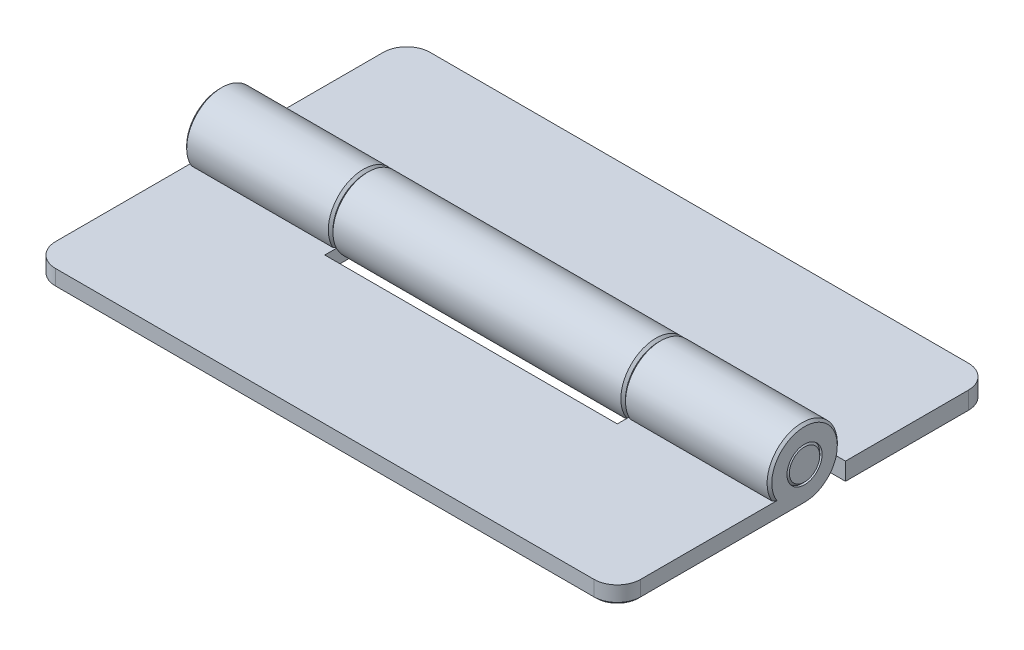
ISO-10303-21;
HEADER;
FILE_DESCRIPTION(('STEP AP214'),'2;1');
FILE_NAME('part.step','',(''),(''),'','','');
FILE_SCHEMA(('AUTOMOTIVE_DESIGN { 1 0 10303 214 1 1 1 1 }'));
ENDSEC;
DATA;
#1=APPLICATION_CONTEXT('core data for automotive mechanical design processes');
#2=APPLICATION_PROTOCOL_DEFINITION('international standard','automotive_design',2000,#1);
#3=PRODUCT_CONTEXT('',#1,'mechanical');
#4=PRODUCT('Part','Part','',(#3));
#5=PRODUCT_RELATED_PRODUCT_CATEGORY('part','',(#4));
#6=PRODUCT_DEFINITION_FORMATION('','',#4);
#7=PRODUCT_DEFINITION_CONTEXT('part definition',#1,'design');
#8=PRODUCT_DEFINITION('design','',#6,#7);
#9=PRODUCT_DEFINITION_SHAPE('','',#8);
#10=(LENGTH_UNIT() NAMED_UNIT(*) SI_UNIT(.MILLI.,.METRE.));
#11=(NAMED_UNIT(*) PLANE_ANGLE_UNIT() SI_UNIT($,.RADIAN.));
#12=(NAMED_UNIT(*) SI_UNIT($,.STERADIAN.) SOLID_ANGLE_UNIT());
#13=UNCERTAINTY_MEASURE_WITH_UNIT(LENGTH_MEASURE(1.E-05),#10,'distance_accuracy_value','');
#14=(GEOMETRIC_REPRESENTATION_CONTEXT(3) GLOBAL_UNCERTAINTY_ASSIGNED_CONTEXT((#13)) GLOBAL_UNIT_ASSIGNED_CONTEXT((#10,
#11,#12)) REPRESENTATION_CONTEXT('',''));
#15=CARTESIAN_POINT('',(0.,0.,0.));
#16=DIRECTION('',(0.,0.,1.));
#17=DIRECTION('',(1.,0.,0.));
#18=AXIS2_PLACEMENT_3D('',#15,#16,#17);
#19=CARTESIAN_POINT('',(25.,0.,0.));
#20=DIRECTION('',(-1.,0.,0.));
#21=DIRECTION('',(0.,0.,1.));
#22=AXIS2_PLACEMENT_3D('',#19,#20,#21);
#23=CYLINDRICAL_SURFACE('',#22,3.);
#24=DIRECTION('',(-1.,0.,0.));
#25=VECTOR('',#24,1.);
#26=CARTESIAN_POINT('',(25.,-1.5,2.59807621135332));
#27=LINE('',#26,#25);
#28=CARTESIAN_POINT('',(24.8,-1.5,2.59807621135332));
#29=VERTEX_POINT('',#28);
#30=CARTESIAN_POINT('',(12.7,-1.5,2.59807621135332));
#31=VERTEX_POINT('',#30);
#32=EDGE_CURVE('P0_E190',#29,#31,#27,.T.);
#33=ORIENTED_EDGE('',*,*,#32,.F.);
#34=CARTESIAN_POINT('',(24.8,0.,0.));
#35=DIRECTION('',(1.,0.,0.));
#36=DIRECTION('',(0.,0.,-1.));
#37=AXIS2_PLACEMENT_3D('',#34,#35,#36);
#38=CIRCLE('',#37,3.);
#39=CARTESIAN_POINT('',(24.8,-3.,0.));
#40=VERTEX_POINT('',#39);
#41=EDGE_CURVE('P0_E206',#29,#40,#38,.F.);
#42=ORIENTED_EDGE('',*,*,#41,.T.);
#43=DIRECTION('',(-1.,0.,0.));
#44=VECTOR('',#43,1.);
#45=CARTESIAN_POINT('',(25.,-3.,0.));
#46=LINE('',#45,#44);
#47=CARTESIAN_POINT('',(12.7,-3.,0.));
#48=VERTEX_POINT('',#47);
#49=EDGE_CURVE('P0_E140',#40,#48,#46,.T.);
#50=ORIENTED_EDGE('',*,*,#49,.T.);
#51=CARTESIAN_POINT('',(12.7,0.,0.));
#52=DIRECTION('',(1.,0.,0.));
#53=DIRECTION('',(0.,0.,-1.));
#54=AXIS2_PLACEMENT_3D('',#51,#52,#53);
#55=CIRCLE('',#54,3.);
#56=EDGE_CURVE('P0_E204',#48,#31,#55,.T.);
#57=ORIENTED_EDGE('',*,*,#56,.T.);
#58=EDGE_LOOP('',(#33,#42,#50,#57));
#59=FACE_BOUND('',#58,.T.);
#60=ADVANCED_FACE('P0_F15',(#59),#23,.T.);
#61=CARTESIAN_POINT('',(25.,0.,0.));
#62=DIRECTION('',(1.,0.,0.));
#63=DIRECTION('',(0.,0.,-1.));
#64=AXIS2_PLACEMENT_3D('',#61,#62,#63);
#65=PLANE('',#64);
#66=CARTESIAN_POINT('',(25.,0.,0.));
#67=DIRECTION('',(1.,0.,0.));
#68=DIRECTION('',(0.,0.,-1.));
#69=AXIS2_PLACEMENT_3D('',#66,#67,#68);
#70=CIRCLE('',#69,2.8);
#71=CARTESIAN_POINT('',(25.,-2.8,0.));
#72=VERTEX_POINT('',#71);
#73=CARTESIAN_POINT('',(25.,-1.5,2.36431808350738));
#74=VERTEX_POINT('',#73);
#75=EDGE_CURVE('P0_E201',#72,#74,#70,.T.);
#76=ORIENTED_EDGE('',*,*,#75,.T.);
#77=DIRECTION('',(0.,0.,-1.));
#78=VECTOR('',#77,1.);
#79=CARTESIAN_POINT('',(25.,-1.5,0.));
#80=LINE('',#79,#78);
#81=CARTESIAN_POINT('',(25.,-1.5,14.));
#82=VERTEX_POINT('',#81);
#83=EDGE_CURVE('P0_E166',#82,#74,#80,.T.);
#84=ORIENTED_EDGE('',*,*,#83,.F.);
#85=DIRECTION('',(0.,-1.,0.));
#86=VECTOR('',#85,1.);
#87=CARTESIAN_POINT('',(25.,-1.5,14.));
#88=LINE('',#87,#86);
#89=CARTESIAN_POINT('',(25.,-2.8,14.));
#90=VERTEX_POINT('',#89);
#91=EDGE_CURVE('P0_E178',#82,#90,#88,.T.);
#92=ORIENTED_EDGE('',*,*,#91,.T.);
#93=DIRECTION('',(0.,0.,-1.));
#94=VECTOR('',#93,1.);
#95=CARTESIAN_POINT('',(25.,-2.8,0.));
#96=LINE('',#95,#94);
#97=EDGE_CURVE('P0_E197',#90,#72,#96,.T.);
#98=ORIENTED_EDGE('',*,*,#97,.T.);
#99=EDGE_LOOP('',(#76,#84,#92,#98));
#100=FACE_BOUND('',#99,.T.);
#101=CARTESIAN_POINT('',(25.,0.,0.));
#102=DIRECTION('',(1.,0.,0.));
#103=DIRECTION('',(0.,0.,-1.));
#104=AXIS2_PLACEMENT_3D('',#101,#102,#103);
#105=CIRCLE('',#104,1.5);
#106=CARTESIAN_POINT('',(25.,0.,-1.5));
#107=VERTEX_POINT('',#106);
#108=EDGE_CURVE('P0_E194',#107,#107,#105,.T.);
#109=ORIENTED_EDGE('',*,*,#108,.F.);
#110=EDGE_LOOP('',(#109));
#111=FACE_BOUND('',#110,.T.);
#112=ADVANCED_FACE('P0_F360',(#100,#111),#65,.T.);
#113=CARTESIAN_POINT('',(12.5,0.,0.));
#114=DIRECTION('',(1.,0.,0.));
#115=DIRECTION('',(0.,0.,-1.));
#116=AXIS2_PLACEMENT_3D('',#113,#114,#115);
#117=PLANE('',#116);
#118=CARTESIAN_POINT('',(12.5,0.,0.));
#119=DIRECTION('',(1.,0.,0.));
#120=DIRECTION('',(0.,0.,-1.));
#121=AXIS2_PLACEMENT_3D('',#118,#119,#120);
#122=CIRCLE('',#121,2.8);
#123=CARTESIAN_POINT('',(12.5,-1.5,2.36431808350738));
#124=VERTEX_POINT('',#123);
#125=CARTESIAN_POINT('',(12.5,-2.8,0.));
#126=VERTEX_POINT('',#125);
#127=EDGE_CURVE('P0_E208',#124,#126,#122,.F.);
#128=ORIENTED_EDGE('',*,*,#127,.T.);
#129=DIRECTION('',(0.,0.,1.));
#130=VECTOR('',#129,1.);
#131=CARTESIAN_POINT('',(12.5,-2.8,3.5));
#132=LINE('',#131,#130);
#133=CARTESIAN_POINT('',(12.5,-2.8,3.5));
#134=VERTEX_POINT('',#133);
#135=EDGE_CURVE('P0_E210',#126,#134,#132,.T.);
#136=ORIENTED_EDGE('',*,*,#135,.T.);
#137=DIRECTION('',(0.,-1.,0.));
#138=VECTOR('',#137,1.);
#139=CARTESIAN_POINT('',(12.5,-1.5,3.5));
#140=LINE('',#139,#138);
#141=CARTESIAN_POINT('',(12.5,-1.5,3.5));
#142=VERTEX_POINT('',#141);
#143=EDGE_CURVE('P0_E187',#142,#134,#140,.T.);
#144=ORIENTED_EDGE('',*,*,#143,.F.);
#145=DIRECTION('',(0.,0.,1.));
#146=VECTOR('',#145,1.);
#147=CARTESIAN_POINT('',(12.5,-1.5,0.));
#148=LINE('',#147,#146);
#149=EDGE_CURVE('P0_E168',#124,#142,#148,.T.);
#150=ORIENTED_EDGE('',*,*,#149,.F.);
#151=EDGE_LOOP('',(#128,#136,#144,#150));
#152=FACE_BOUND('',#151,.T.);
#153=CARTESIAN_POINT('',(12.5,0.,0.));
#154=DIRECTION('',(1.,0.,0.));
#155=DIRECTION('',(0.,0.,-1.));
#156=AXIS2_PLACEMENT_3D('',#153,#154,#155);
#157=CIRCLE('',#156,1.5);
#158=CARTESIAN_POINT('',(12.5,0.,-1.5));
#159=VERTEX_POINT('',#158);
#160=EDGE_CURVE('P0_E193',#159,#159,#157,.T.);
#161=ORIENTED_EDGE('',*,*,#160,.T.);
#162=EDGE_LOOP('',(#161));
#163=FACE_BOUND('',#162,.T.);
#164=ADVANCED_FACE('P0_F365',(#152,#163),#117,.F.);
#165=CARTESIAN_POINT('',(25.,0.,0.));
#166=DIRECTION('',(-1.,0.,0.));
#167=DIRECTION('',(0.,0.,1.));
#168=AXIS2_PLACEMENT_3D('',#165,#166,#167);
#169=CYLINDRICAL_SURFACE('',#168,1.5);
#170=ORIENTED_EDGE('',*,*,#160,.F.);
#171=EDGE_LOOP('',(#170));
#172=FACE_BOUND('',#171,.T.);
#173=ORIENTED_EDGE('',*,*,#108,.T.);
#174=EDGE_LOOP('',(#173));
#175=FACE_BOUND('',#174,.T.);
#176=ADVANCED_FACE('P0_F561',(#172,#175),#169,.F.);
#177=CARTESIAN_POINT('',(23.,-1.5,14.));
#178=DIRECTION('',(0.,-1.,0.));
#179=DIRECTION('',(0.,0.,-1.));
#180=AXIS2_PLACEMENT_3D('',#177,#178,#179);
#181=PLANE('',#180);
#182=DIRECTION('',(0.,0.,1.));
#183=VECTOR('',#182,1.);
#184=CARTESIAN_POINT('',(-12.5,-1.5,0.));
#185=LINE('',#184,#183);
#186=CARTESIAN_POINT('',(-12.5,-1.5,2.36431808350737));
#187=VERTEX_POINT('',#186);
#188=CARTESIAN_POINT('',(-12.5,-1.5,3.5));
#189=VERTEX_POINT('',#188);
#190=EDGE_CURVE('P0_E154',#187,#189,#185,.T.);
#191=ORIENTED_EDGE('',*,*,#190,.F.);
#192=CARTESIAN_POINT('',(-12.5,-1.5,2.36431808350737));
#193=CARTESIAN_POINT('',(-12.5330904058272,-1.5,2.4034856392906));
#194=CARTESIAN_POINT('',(-12.566302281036,-1.5,2.44254926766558));
#195=CARTESIAN_POINT('',(-12.6329689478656,-1.5,2.52046864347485));
#196=CARTESIAN_POINT('',(-12.6664237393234,-1.5,2.55932439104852));
#197=CARTESIAN_POINT('',(-12.7,-1.5,2.59807621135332));
#198=B_SPLINE_CURVE_WITH_KNOTS('',3,(#192,#193,#194,#195,#196,#197),.UNSPECIFIED.,.F.,.F.,(4,2,
4),(0.,0.153821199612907,0.307642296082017),.UNSPECIFIED.);
#199=CARTESIAN_POINT('',(-12.7,-1.5,2.59807621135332));
#200=VERTEX_POINT('',#199);
#201=EDGE_CURVE('P0_E25',#187,#200,#198,.T.);
#202=ORIENTED_EDGE('',*,*,#201,.T.);
#203=DIRECTION('',(1.,0.,0.));
#204=VECTOR('',#203,1.);
#205=CARTESIAN_POINT('',(-25.,-1.5,2.59807621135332));
#206=LINE('',#205,#204);
#207=CARTESIAN_POINT('',(-24.8,-1.5,2.59807621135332));
#208=VERTEX_POINT('',#207);
#209=EDGE_CURVE('P0_E162',#200,#208,#206,.F.);
#210=ORIENTED_EDGE('',*,*,#209,.T.);
#211=CARTESIAN_POINT('',(-24.8,-1.5,2.59807621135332));
#212=CARTESIAN_POINT('',(-24.8335762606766,-1.5,2.55932439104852));
#213=CARTESIAN_POINT('',(-24.8670310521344,-1.5,2.52046864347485));
#214=CARTESIAN_POINT('',(-24.933697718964,-1.5,2.44254926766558));
#215=CARTESIAN_POINT('',(-24.9669095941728,-1.5,2.4034856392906));
#216=CARTESIAN_POINT('',(-25.,-1.5,2.36431808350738));
#217=B_SPLINE_CURVE_WITH_KNOTS('',3,(#211,#212,#213,#214,#215,#216),.UNSPECIFIED.,.F.,.F.,(4,2,
4),(0.,0.153821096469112,0.307642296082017),.UNSPECIFIED.);
#218=CARTESIAN_POINT('',(-25.,-1.5,2.36431808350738));
#219=VERTEX_POINT('',#218);
#220=EDGE_CURVE('P0_E10',#208,#219,#217,.T.);
#221=ORIENTED_EDGE('',*,*,#220,.T.);
#222=DIRECTION('',(0.,0.,-1.));
#223=VECTOR('',#222,1.);
#224=CARTESIAN_POINT('',(-25.,-1.5,0.));
#225=LINE('',#224,#223);
#226=CARTESIAN_POINT('',(-25.,-1.5,14.));
#227=VERTEX_POINT('',#226);
#228=EDGE_CURVE('P0_E38',#227,#219,#225,.T.);
#229=ORIENTED_EDGE('',*,*,#228,.F.);
#230=CARTESIAN_POINT('',(-23.,-1.5,14.));
#231=DIRECTION('',(0.,-1.,0.));
#232=DIRECTION('',(0.,0.,-1.));
#233=AXIS2_PLACEMENT_3D('',#230,#231,#232);
#234=CIRCLE('',#233,2.);
#235=CARTESIAN_POINT('',(-23.,-1.5,16.));
#236=VERTEX_POINT('',#235);
#237=EDGE_CURVE('P0_E146',#236,#227,#234,.T.);
#238=ORIENTED_EDGE('',*,*,#237,.F.);
#239=DIRECTION('',(1.,0.,0.));
#240=VECTOR('',#239,1.);
#241=CARTESIAN_POINT('',(23.,-1.5,16.));
#242=LINE('',#241,#240);
#243=CARTESIAN_POINT('',(23.,-1.5,16.));
#244=VERTEX_POINT('',#243);
#245=EDGE_CURVE('P0_E174',#236,#244,#242,.T.);
#246=ORIENTED_EDGE('',*,*,#245,.T.);
#247=CARTESIAN_POINT('',(23.,-1.5,14.));
#248=DIRECTION('',(0.,1.,0.));
#249=DIRECTION('',(0.,0.,-1.));
#250=AXIS2_PLACEMENT_3D('',#247,#248,#249);
#251=CIRCLE('',#250,2.);
#252=EDGE_CURVE('P0_E176',#244,#82,#251,.T.);
#253=ORIENTED_EDGE('',*,*,#252,.T.);
#254=ORIENTED_EDGE('',*,*,#83,.T.);
#255=CARTESIAN_POINT('',(25.,-1.5,2.36431808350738));
#256=CARTESIAN_POINT('',(24.9669095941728,-1.5,2.40348563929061));
#257=CARTESIAN_POINT('',(24.933697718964,-1.5,2.44254926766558));
#258=CARTESIAN_POINT('',(24.8670310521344,-1.5,2.52046864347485));
#259=CARTESIAN_POINT('',(24.8335762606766,-1.5,2.55932439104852));
#260=CARTESIAN_POINT('',(24.8,-1.5,2.59807621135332));
#261=B_SPLINE_CURVE_WITH_KNOTS('',3,(#255,#256,#257,#258,#259,#260),.UNSPECIFIED.,.F.,.F.,(4,2,
4),(0.,0.153821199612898,0.307642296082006),.UNSPECIFIED.);
#262=EDGE_CURVE('P0_E245',#74,#29,#261,.T.);
#263=ORIENTED_EDGE('',*,*,#262,.T.);
#264=ORIENTED_EDGE('',*,*,#32,.T.);
#265=CARTESIAN_POINT('',(12.7,-1.5,2.59807621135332));
#266=CARTESIAN_POINT('',(12.6664237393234,-1.5,2.55932439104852));
#267=CARTESIAN_POINT('',(12.6329689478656,-1.5,2.52046864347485));
#268=CARTESIAN_POINT('',(12.566302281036,-1.5,2.44254926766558));
#269=CARTESIAN_POINT('',(12.5330904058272,-1.5,2.40348563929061));
#270=CARTESIAN_POINT('',(12.5,-1.5,2.36431808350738));
#271=B_SPLINE_CURVE_WITH_KNOTS('',3,(#265,#266,#267,#268,#269,#270),.UNSPECIFIED.,.F.,.F.,(4,2,
4),(0.,0.15382109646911,0.307642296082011),.UNSPECIFIED.);
#272=EDGE_CURVE('P0_E346',#31,#124,#271,.T.);
#273=ORIENTED_EDGE('',*,*,#272,.T.);
#274=ORIENTED_EDGE('',*,*,#149,.T.);
#275=DIRECTION('',(-1.,0.,0.));
#276=VECTOR('',#275,1.);
#277=CARTESIAN_POINT('',(12.5,-1.5,3.5));
#278=LINE('',#277,#276);
#279=EDGE_CURVE('P0_E171',#142,#189,#278,.T.);
#280=ORIENTED_EDGE('',*,*,#279,.T.);
#281=EDGE_LOOP('',(#191,#202,#210,#221,#229,#238,#246,#253,#254,#263,#264,#273,#274,#280));
#282=FACE_BOUND('',#281,.T.);
#283=ADVANCED_FACE('P0_F145',(#282),#181,.F.);
#284=CARTESIAN_POINT('',(12.5,-1.5,3.5));
#285=DIRECTION('',(0.,0.,1.));
#286=DIRECTION('',(1.,0.,0.));
#287=AXIS2_PLACEMENT_3D('',#284,#285,#286);
#288=PLANE('',#287);
#289=DIRECTION('',(-1.,0.,0.));
#290=VECTOR('',#289,1.);
#291=CARTESIAN_POINT('',(12.5,-3.,3.5));
#292=LINE('',#291,#290);
#293=CARTESIAN_POINT('',(12.7,-3.,3.5));
#294=VERTEX_POINT('',#293);
#295=CARTESIAN_POINT('',(-12.7,-3.,3.50000000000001));
#296=VERTEX_POINT('',#295);
#297=EDGE_CURVE('P0_E169',#294,#296,#292,.T.);
#298=ORIENTED_EDGE('',*,*,#297,.T.);
#299=DIRECTION('',(-0.707106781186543,-0.707106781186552,0.));
#300=VECTOR('',#299,1.);
#301=CARTESIAN_POINT('',(0.649999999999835,10.35,3.5));
#302=LINE('',#301,#300);
#303=CARTESIAN_POINT('',(-12.5,-2.8,3.5));
#304=VERTEX_POINT('',#303);
#305=EDGE_CURVE('P0_E344',#296,#304,#302,.F.);
#306=ORIENTED_EDGE('',*,*,#305,.T.);
#307=DIRECTION('',(0.,-1.,0.));
#308=VECTOR('',#307,1.);
#309=CARTESIAN_POINT('',(-12.5,-1.5,3.5));
#310=LINE('',#309,#308);
#311=EDGE_CURVE('P0_E156',#189,#304,#310,.T.);
#312=ORIENTED_EDGE('',*,*,#311,.F.);
#313=ORIENTED_EDGE('',*,*,#279,.F.);
#314=ORIENTED_EDGE('',*,*,#143,.T.);
#315=DIRECTION('',(0.707106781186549,-0.707106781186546,0.));
#316=VECTOR('',#315,1.);
#317=CARTESIAN_POINT('',(11.85,-2.15,3.5));
#318=LINE('',#317,#316);
#319=EDGE_CURVE('P0_E252',#134,#294,#318,.T.);
#320=ORIENTED_EDGE('',*,*,#319,.T.);
#321=EDGE_LOOP('',(#298,#306,#312,#313,#314,#320));
#322=FACE_BOUND('',#321,.T.);
#323=ADVANCED_FACE('P0_F343',(#322),#288,.F.);
#324=CARTESIAN_POINT('',(23.,-1.5,16.));
#325=DIRECTION('',(0.,0.,-1.));
#326=DIRECTION('',(-1.,0.,0.));
#327=AXIS2_PLACEMENT_3D('',#324,#325,#326);
#328=PLANE('',#327);
#329=DIRECTION('',(0.,-1.,0.));
#330=VECTOR('',#329,1.);
#331=CARTESIAN_POINT('',(-23.,-1.5,16.));
#332=LINE('',#331,#330);
#333=CARTESIAN_POINT('',(-23.,-2.8,16.));
#334=VERTEX_POINT('',#333);
#335=EDGE_CURVE('P0_E141',#236,#334,#332,.T.);
#336=ORIENTED_EDGE('',*,*,#335,.T.);
#337=DIRECTION('',(1.,0.,0.));
#338=VECTOR('',#337,1.);
#339=CARTESIAN_POINT('',(23.,-2.8,16.));
#340=LINE('',#339,#338);
#341=CARTESIAN_POINT('',(23.,-2.8,16.));
#342=VERTEX_POINT('',#341);
#343=EDGE_CURVE('P0_E239',#334,#342,#340,.T.);
#344=ORIENTED_EDGE('',*,*,#343,.T.);
#345=DIRECTION('',(0.,-1.,0.));
#346=VECTOR('',#345,1.);
#347=CARTESIAN_POINT('',(23.,-1.5,16.));
#348=LINE('',#347,#346);
#349=EDGE_CURVE('P0_E184',#244,#342,#348,.T.);
#350=ORIENTED_EDGE('',*,*,#349,.F.);
#351=ORIENTED_EDGE('',*,*,#245,.F.);
#352=EDGE_LOOP('',(#336,#344,#350,#351));
#353=FACE_BOUND('',#352,.T.);
#354=ADVANCED_FACE('P0_F537',(#353),#328,.F.);
#355=CARTESIAN_POINT('',(23.,-1.5,14.));
#356=DIRECTION('',(0.,-1.,0.));
#357=DIRECTION('',(0.,0.,-1.));
#358=AXIS2_PLACEMENT_3D('',#355,#356,#357);
#359=CYLINDRICAL_SURFACE('',#358,2.);
#360=ORIENTED_EDGE('',*,*,#349,.T.);
#361=CARTESIAN_POINT('',(23.,-2.8,14.));
#362=DIRECTION('',(0.,-1.,0.));
#363=DIRECTION('',(0.,0.,-1.));
#364=AXIS2_PLACEMENT_3D('',#361,#362,#363);
#365=CIRCLE('',#364,2.);
#366=EDGE_CURVE('P0_E237',#342,#90,#365,.F.);
#367=ORIENTED_EDGE('',*,*,#366,.T.);
#368=ORIENTED_EDGE('',*,*,#91,.F.);
#369=ORIENTED_EDGE('',*,*,#252,.F.);
#370=EDGE_LOOP('',(#360,#367,#368,#369));
#371=FACE_BOUND('',#370,.T.);
#372=ADVANCED_FACE('P0_F416',(#371),#359,.T.);
#373=CARTESIAN_POINT('',(23.,-3.,14.));
#374=DIRECTION('',(0.,-1.,0.));
#375=DIRECTION('',(0.,0.,-1.));
#376=AXIS2_PLACEMENT_3D('',#373,#374,#375);
#377=PLANE('',#376);
#378=ORIENTED_EDGE('',*,*,#297,.F.);
#379=DIRECTION('',(0.,0.,-1.));
#380=VECTOR('',#379,1.);
#381=CARTESIAN_POINT('',(12.7,-3.,0.));
#382=LINE('',#381,#380);
#383=EDGE_CURVE('P0_E226',#294,#48,#382,.T.);
#384=ORIENTED_EDGE('',*,*,#383,.T.);
#385=ORIENTED_EDGE('',*,*,#49,.F.);
#386=DIRECTION('',(0.,0.,1.));
#387=VECTOR('',#386,1.);
#388=CARTESIAN_POINT('',(24.8,-3.,14.));
#389=LINE('',#388,#387);
#390=CARTESIAN_POINT('',(24.8,-3.,14.));
#391=VERTEX_POINT('',#390);
#392=EDGE_CURVE('P0_E221',#40,#391,#389,.T.);
#393=ORIENTED_EDGE('',*,*,#392,.T.);
#394=CARTESIAN_POINT('',(23.,-3.,14.));
#395=DIRECTION('',(0.,-1.,0.));
#396=DIRECTION('',(0.,0.,-1.));
#397=AXIS2_PLACEMENT_3D('',#394,#395,#396);
#398=CIRCLE('',#397,1.8);
#399=CARTESIAN_POINT('',(23.,-3.,15.8));
#400=VERTEX_POINT('',#399);
#401=EDGE_CURVE('P0_E219',#391,#400,#398,.T.);
#402=ORIENTED_EDGE('',*,*,#401,.T.);
#403=DIRECTION('',(-1.,0.,0.));
#404=VECTOR('',#403,1.);
#405=CARTESIAN_POINT('',(-23.,-3.,15.8));
#406=LINE('',#405,#404);
#407=CARTESIAN_POINT('',(-23.,-3.,15.8));
#408=VERTEX_POINT('',#407);
#409=EDGE_CURVE('P0_E217',#400,#408,#406,.T.);
#410=ORIENTED_EDGE('',*,*,#409,.T.);
#411=CARTESIAN_POINT('',(-23.,-3.,14.));
#412=DIRECTION('',(0.,-1.,0.));
#413=DIRECTION('',(0.,0.,-1.));
#414=AXIS2_PLACEMENT_3D('',#411,#412,#413);
#415=CIRCLE('',#414,1.79999999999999);
#416=CARTESIAN_POINT('',(-24.8,-3.,14.));
#417=VERTEX_POINT('',#416);
#418=EDGE_CURVE('P0_E215',#408,#417,#415,.T.);
#419=ORIENTED_EDGE('',*,*,#418,.T.);
#420=DIRECTION('',(0.,0.,-1.));
#421=VECTOR('',#420,1.);
#422=CARTESIAN_POINT('',(-24.8,-3.,14.));
#423=LINE('',#422,#421);
#424=CARTESIAN_POINT('',(-24.8,-3.,0.));
#425=VERTEX_POINT('',#424);
#426=EDGE_CURVE('P0_E213',#417,#425,#423,.T.);
#427=ORIENTED_EDGE('',*,*,#426,.T.);
#428=DIRECTION('',(1.,0.,0.));
#429=VECTOR('',#428,1.);
#430=CARTESIAN_POINT('',(-25.,-3.,0.));
#431=LINE('',#430,#429);
#432=CARTESIAN_POINT('',(-12.7,-3.,0.));
#433=VERTEX_POINT('',#432);
#434=EDGE_CURVE('P0_E149',#425,#433,#431,.T.);
#435=ORIENTED_EDGE('',*,*,#434,.T.);
#436=DIRECTION('',(0.,0.,1.));
#437=VECTOR('',#436,1.);
#438=CARTESIAN_POINT('',(-12.7,-3.,14.));
#439=LINE('',#438,#437);
#440=EDGE_CURVE('P0_E223',#433,#296,#439,.T.);
#441=ORIENTED_EDGE('',*,*,#440,.T.);
#442=EDGE_LOOP('',(#378,#384,#385,#393,#402,#410,#419,#427,#435,#441));
#443=FACE_BOUND('',#442,.T.);
#444=ADVANCED_FACE('P0_F381',(#443),#377,.T.);
#445=CARTESIAN_POINT('',(-25.,-1.5,0.));
#446=DIRECTION('',(-1.,0.,0.));
#447=DIRECTION('',(0.,0.,1.));
#448=AXIS2_PLACEMENT_3D('',#445,#446,#447);
#449=PLANE('',#448);
#450=CARTESIAN_POINT('',(-25.,0.,0.));
#451=DIRECTION('',(1.,0.,0.));
#452=DIRECTION('',(0.,0.,-1.));
#453=AXIS2_PLACEMENT_3D('',#450,#451,#452);
#454=CIRCLE('',#453,1.5);
#455=CARTESIAN_POINT('',(-25.,0.,-1.5));
#456=VERTEX_POINT('',#455);
#457=EDGE_CURVE('P0_E395',#456,#456,#454,.T.);
#458=ORIENTED_EDGE('',*,*,#457,.T.);
#459=EDGE_LOOP('',(#458));
#460=FACE_BOUND('',#459,.T.);
#461=CARTESIAN_POINT('',(-25.,0.,0.));
#462=DIRECTION('',(-1.,0.,0.));
#463=DIRECTION('',(0.,0.,1.));
#464=AXIS2_PLACEMENT_3D('',#461,#462,#463);
#465=CIRCLE('',#464,2.8);
#466=CARTESIAN_POINT('',(-25.,-2.8,0.));
#467=VERTEX_POINT('',#466);
#468=EDGE_CURVE('P0_E33',#219,#467,#465,.T.);
#469=ORIENTED_EDGE('',*,*,#468,.T.);
#470=DIRECTION('',(0.,0.,1.));
#471=VECTOR('',#470,1.);
#472=CARTESIAN_POINT('',(-25.,-2.8,0.));
#473=LINE('',#472,#471);
#474=CARTESIAN_POINT('',(-25.,-2.8,14.));
#475=VERTEX_POINT('',#474);
#476=EDGE_CURVE('P0_E136',#467,#475,#473,.T.);
#477=ORIENTED_EDGE('',*,*,#476,.T.);
#478=DIRECTION('',(0.,-1.,0.));
#479=VECTOR('',#478,1.);
#480=CARTESIAN_POINT('',(-25.,-1.5,14.));
#481=LINE('',#480,#479);
#482=EDGE_CURVE('P0_E133',#227,#475,#481,.T.);
#483=ORIENTED_EDGE('',*,*,#482,.F.);
#484=ORIENTED_EDGE('',*,*,#228,.T.);
#485=EDGE_LOOP('',(#469,#477,#483,#484));
#486=FACE_BOUND('',#485,.T.);
#487=ADVANCED_FACE('P0_F134',(#460,#486),#449,.T.);
#488=CARTESIAN_POINT('',(-23.,-1.5,14.));
#489=DIRECTION('',(0.,-1.,0.));
#490=DIRECTION('',(0.,0.,-1.));
#491=AXIS2_PLACEMENT_3D('',#488,#489,#490);
#492=CYLINDRICAL_SURFACE('',#491,2.);
#493=ORIENTED_EDGE('',*,*,#482,.T.);
#494=CARTESIAN_POINT('',(-23.,-2.8,14.));
#495=DIRECTION('',(0.,-1.,0.));
#496=DIRECTION('',(0.,0.,-1.));
#497=AXIS2_PLACEMENT_3D('',#494,#495,#496);
#498=CIRCLE('',#497,2.);
#499=EDGE_CURVE('P0_E241',#475,#334,#498,.F.);
#500=ORIENTED_EDGE('',*,*,#499,.T.);
#501=ORIENTED_EDGE('',*,*,#335,.F.);
#502=ORIENTED_EDGE('',*,*,#237,.T.);
#503=EDGE_LOOP('',(#493,#500,#501,#502));
#504=FACE_BOUND('',#503,.T.);
#505=ADVANCED_FACE('P0_F152',(#504),#492,.T.);
#506=CARTESIAN_POINT('',(-12.5,-1.5,0.));
#507=DIRECTION('',(1.,0.,0.));
#508=DIRECTION('',(0.,0.,-1.));
#509=AXIS2_PLACEMENT_3D('',#506,#507,#508);
#510=PLANE('',#509);
#511=ORIENTED_EDGE('',*,*,#311,.T.);
#512=DIRECTION('',(0.,0.,-1.));
#513=VECTOR('',#512,1.);
#514=CARTESIAN_POINT('',(-12.5,-2.8,0.));
#515=LINE('',#514,#513);
#516=CARTESIAN_POINT('',(-12.5,-2.8,0.));
#517=VERTEX_POINT('',#516);
#518=EDGE_CURVE('P0_E231',#304,#517,#515,.T.);
#519=ORIENTED_EDGE('',*,*,#518,.T.);
#520=CARTESIAN_POINT('',(-12.5,0.,0.));
#521=DIRECTION('',(1.,0.,0.));
#522=DIRECTION('',(0.,0.,-1.));
#523=AXIS2_PLACEMENT_3D('',#520,#521,#522);
#524=CIRCLE('',#523,2.8);
#525=EDGE_CURVE('P0_E228',#517,#187,#524,.T.);
#526=ORIENTED_EDGE('',*,*,#525,.T.);
#527=ORIENTED_EDGE('',*,*,#190,.T.);
#528=EDGE_LOOP('',(#511,#519,#526,#527));
#529=FACE_BOUND('',#528,.T.);
#530=CARTESIAN_POINT('',(-12.5,0.,0.));
#531=DIRECTION('',(1.,0.,0.));
#532=DIRECTION('',(0.,0.,-1.));
#533=AXIS2_PLACEMENT_3D('',#530,#531,#532);
#534=CIRCLE('',#533,1.5);
#535=CARTESIAN_POINT('',(-12.5,0.,-1.5));
#536=VERTEX_POINT('',#535);
#537=EDGE_CURVE('P0_E320',#536,#536,#534,.T.);
#538=ORIENTED_EDGE('',*,*,#537,.F.);
#539=EDGE_LOOP('',(#538));
#540=FACE_BOUND('',#539,.T.);
#541=ADVANCED_FACE('P0_F338',(#529,#540),#510,.T.);
#542=CARTESIAN_POINT('',(-25.,0.,0.));
#543=DIRECTION('',(1.,0.,0.));
#544=DIRECTION('',(0.,0.,-1.));
#545=AXIS2_PLACEMENT_3D('',#542,#543,#544);
#546=CYLINDRICAL_SURFACE('',#545,3.);
#547=ORIENTED_EDGE('',*,*,#209,.F.);
#548=CARTESIAN_POINT('',(-12.7,0.,0.));
#549=DIRECTION('',(1.,0.,0.));
#550=DIRECTION('',(0.,0.,-1.));
#551=AXIS2_PLACEMENT_3D('',#548,#549,#550);
#552=CIRCLE('',#551,3.);
#553=EDGE_CURVE('P0_E235',#200,#433,#552,.F.);
#554=ORIENTED_EDGE('',*,*,#553,.T.);
#555=ORIENTED_EDGE('',*,*,#434,.F.);
#556=CARTESIAN_POINT('',(-24.8,0.,0.));
#557=DIRECTION('',(-1.,0.,0.));
#558=DIRECTION('',(0.,0.,1.));
#559=AXIS2_PLACEMENT_3D('',#556,#557,#558);
#560=CIRCLE('',#559,3.);
#561=EDGE_CURVE('P0_E233',#425,#208,#560,.F.);
#562=ORIENTED_EDGE('',*,*,#561,.T.);
#563=EDGE_LOOP('',(#547,#554,#555,#562));
#564=FACE_BOUND('',#563,.T.);
#565=ADVANCED_FACE('P0_F394',(#564),#546,.T.);
#566=CARTESIAN_POINT('',(-25.,0.,0.));
#567=DIRECTION('',(1.,0.,0.));
#568=DIRECTION('',(0.,0.,-1.));
#569=AXIS2_PLACEMENT_3D('',#566,#567,#568);
#570=CYLINDRICAL_SURFACE('',#569,1.5);
#571=ORIENTED_EDGE('',*,*,#457,.F.);
#572=EDGE_LOOP('',(#571));
#573=FACE_BOUND('',#572,.T.);
#574=ORIENTED_EDGE('',*,*,#537,.T.);
#575=EDGE_LOOP('',(#574));
#576=FACE_BOUND('',#575,.T.);
#577=ADVANCED_FACE('P0_F289',(#573,#576),#570,.F.);
#578=CARTESIAN_POINT('',(-24.8,0.,0.));
#579=DIRECTION('',(1.,0.,0.));
#580=DIRECTION('',(0.,0.,-1.));
#581=AXIS2_PLACEMENT_3D('',#578,#579,#580);
#582=CONICAL_SURFACE('',#581,3.,0.785398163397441);
#583=ORIENTED_EDGE('',*,*,#220,.F.);
#584=ORIENTED_EDGE('',*,*,#561,.F.);
#585=DIRECTION('',(0.707106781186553,-0.707106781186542,0.));
#586=VECTOR('',#585,1.);
#587=CARTESIAN_POINT('',(-25.,-2.8,0.));
#588=LINE('',#587,#586);
#589=EDGE_CURVE('P0_E318',#467,#425,#588,.T.);
#590=ORIENTED_EDGE('',*,*,#589,.F.);
#591=ORIENTED_EDGE('',*,*,#468,.F.);
#592=EDGE_LOOP('',(#583,#584,#590,#591));
#593=FACE_BOUND('',#592,.T.);
#594=ADVANCED_FACE('P0_F284',(#593),#582,.T.);
#595=CARTESIAN_POINT('',(-24.8,-3.,14.));
#596=DIRECTION('',(0.707106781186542,0.707106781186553,0.));
#597=DIRECTION('',(0.,0.,-1.));
#598=AXIS2_PLACEMENT_3D('',#595,#596,#597);
#599=PLANE('',#598);
#600=ORIENTED_EDGE('',*,*,#589,.T.);
#601=ORIENTED_EDGE('',*,*,#426,.F.);
#602=DIRECTION('',(0.707106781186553,-0.707106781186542,0.));
#603=VECTOR('',#602,1.);
#604=CARTESIAN_POINT('',(-25.,-2.8,14.));
#605=LINE('',#604,#603);
#606=EDGE_CURVE('P0_E315',#475,#417,#605,.T.);
#607=ORIENTED_EDGE('',*,*,#606,.F.);
#608=ORIENTED_EDGE('',*,*,#476,.F.);
#609=EDGE_LOOP('',(#600,#601,#607,#608));
#610=FACE_BOUND('',#609,.T.);
#611=ADVANCED_FACE('P0_F280',(#610),#599,.F.);
#612=CARTESIAN_POINT('',(-23.,-3.,14.));
#613=DIRECTION('',(0.,1.,0.));
#614=DIRECTION('',(0.,0.,1.));
#615=AXIS2_PLACEMENT_3D('',#612,#613,#614);
#616=CONICAL_SURFACE('',#615,1.79999999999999,0.785398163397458);
#617=ORIENTED_EDGE('',*,*,#606,.T.);
#618=ORIENTED_EDGE('',*,*,#418,.F.);
#619=DIRECTION('',(0.,-0.707106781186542,-0.707106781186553));
#620=VECTOR('',#619,1.);
#621=CARTESIAN_POINT('',(-23.,-2.8,16.));
#622=LINE('',#621,#620);
#623=EDGE_CURVE('P0_E312',#334,#408,#622,.T.);
#624=ORIENTED_EDGE('',*,*,#623,.F.);
#625=ORIENTED_EDGE('',*,*,#499,.F.);
#626=EDGE_LOOP('',(#617,#618,#624,#625));
#627=FACE_BOUND('',#626,.T.);
#628=ADVANCED_FACE('P0_F276',(#627),#616,.T.);
#629=CARTESIAN_POINT('',(23.,-2.8,16.));
#630=DIRECTION('',(0.,-0.707106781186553,0.707106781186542));
#631=DIRECTION('',(-1.,0.,0.));
#632=AXIS2_PLACEMENT_3D('',#629,#630,#631);
#633=PLANE('',#632);
#634=ORIENTED_EDGE('',*,*,#623,.T.);
#635=ORIENTED_EDGE('',*,*,#409,.F.);
#636=DIRECTION('',(0.,-0.707106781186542,-0.707106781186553));
#637=VECTOR('',#636,1.);
#638=CARTESIAN_POINT('',(23.,-2.8,16.));
#639=LINE('',#638,#637);
#640=EDGE_CURVE('P0_E309',#342,#400,#639,.T.);
#641=ORIENTED_EDGE('',*,*,#640,.F.);
#642=ORIENTED_EDGE('',*,*,#343,.F.);
#643=EDGE_LOOP('',(#634,#635,#641,#642));
#644=FACE_BOUND('',#643,.T.);
#645=ADVANCED_FACE('P0_F272',(#644),#633,.T.);
#646=CARTESIAN_POINT('',(23.,-2.8,14.));
#647=DIRECTION('',(0.,1.,0.));
#648=DIRECTION('',(0.,0.,1.));
#649=AXIS2_PLACEMENT_3D('',#646,#647,#648);
#650=CONICAL_SURFACE('',#649,2.,0.785398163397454);
#651=ORIENTED_EDGE('',*,*,#640,.T.);
#652=ORIENTED_EDGE('',*,*,#401,.F.);
#653=DIRECTION('',(-0.707106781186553,-0.707106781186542,0.));
#654=VECTOR('',#653,1.);
#655=CARTESIAN_POINT('',(25.,-2.8,14.));
#656=LINE('',#655,#654);
#657=EDGE_CURVE('P0_E305',#90,#391,#656,.T.);
#658=ORIENTED_EDGE('',*,*,#657,.F.);
#659=ORIENTED_EDGE('',*,*,#366,.F.);
#660=EDGE_LOOP('',(#651,#652,#658,#659));
#661=FACE_BOUND('',#660,.T.);
#662=ADVANCED_FACE('P0_F268',(#661),#650,.T.);
#663=CARTESIAN_POINT('',(25.,-2.8,0.));
#664=DIRECTION('',(-0.707106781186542,0.707106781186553,0.));
#665=DIRECTION('',(0.,0.,-1.));
#666=AXIS2_PLACEMENT_3D('',#663,#664,#665);
#667=PLANE('',#666);
#668=ORIENTED_EDGE('',*,*,#657,.T.);
#669=ORIENTED_EDGE('',*,*,#392,.F.);
#670=DIRECTION('',(-0.707106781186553,-0.707106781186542,0.));
#671=VECTOR('',#670,1.);
#672=CARTESIAN_POINT('',(25.,-2.8,0.));
#673=LINE('',#672,#671);
#674=EDGE_CURVE('P0_E302',#72,#40,#673,.T.);
#675=ORIENTED_EDGE('',*,*,#674,.F.);
#676=ORIENTED_EDGE('',*,*,#97,.F.);
#677=EDGE_LOOP('',(#668,#669,#675,#676));
#678=FACE_BOUND('',#677,.T.);
#679=ADVANCED_FACE('P0_F263',(#678),#667,.F.);
#680=CARTESIAN_POINT('',(25.,0.,0.));
#681=DIRECTION('',(-1.,0.,0.));
#682=DIRECTION('',(0.,0.,1.));
#683=AXIS2_PLACEMENT_3D('',#680,#681,#682);
#684=CONICAL_SURFACE('',#683,2.8,0.785398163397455);
#685=ORIENTED_EDGE('',*,*,#674,.T.);
#686=ORIENTED_EDGE('',*,*,#41,.F.);
#687=ORIENTED_EDGE('',*,*,#262,.F.);
#688=ORIENTED_EDGE('',*,*,#75,.F.);
#689=EDGE_LOOP('',(#685,#686,#687,#688));
#690=FACE_BOUND('',#689,.T.);
#691=ADVANCED_FACE('P0_F257',(#690),#684,.T.);
#692=CARTESIAN_POINT('',(12.7,0.,0.));
#693=DIRECTION('',(1.,0.,0.));
#694=DIRECTION('',(0.,0.,-1.));
#695=AXIS2_PLACEMENT_3D('',#692,#693,#694);
#696=CONICAL_SURFACE('',#695,3.,0.785398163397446);
#697=ORIENTED_EDGE('',*,*,#272,.F.);
#698=ORIENTED_EDGE('',*,*,#56,.F.);
#699=DIRECTION('',(0.707106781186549,-0.707106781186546,0.));
#700=VECTOR('',#699,1.);
#701=CARTESIAN_POINT('',(12.5,-2.8,0.));
#702=LINE('',#701,#700);
#703=EDGE_CURVE('P0_E306',#126,#48,#702,.T.);
#704=ORIENTED_EDGE('',*,*,#703,.F.);
#705=ORIENTED_EDGE('',*,*,#127,.F.);
#706=EDGE_LOOP('',(#697,#698,#704,#705));
#707=FACE_BOUND('',#706,.T.);
#708=ADVANCED_FACE('P0_F262',(#707),#696,.T.);
#709=CARTESIAN_POINT('',(12.5,-2.8,0.));
#710=DIRECTION('',(-0.707106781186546,-0.707106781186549,0.));
#711=DIRECTION('',(0.,0.,-1.));
#712=AXIS2_PLACEMENT_3D('',#709,#710,#711);
#713=PLANE('',#712);
#714=ORIENTED_EDGE('',*,*,#703,.T.);
#715=ORIENTED_EDGE('',*,*,#383,.F.);
#716=ORIENTED_EDGE('',*,*,#319,.F.);
#717=ORIENTED_EDGE('',*,*,#135,.F.);
#718=EDGE_LOOP('',(#714,#715,#716,#717));
#719=FACE_BOUND('',#718,.T.);
#720=ADVANCED_FACE('P0_F291',(#719),#713,.T.);
#721=CARTESIAN_POINT('',(-12.5,0.,0.));
#722=DIRECTION('',(-1.,0.,0.));
#723=DIRECTION('',(0.,0.,1.));
#724=AXIS2_PLACEMENT_3D('',#721,#722,#723);
#725=CONICAL_SURFACE('',#724,2.8,0.785398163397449);
#726=ORIENTED_EDGE('',*,*,#201,.F.);
#727=ORIENTED_EDGE('',*,*,#525,.F.);
#728=DIRECTION('',(0.707106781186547,0.707106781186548,0.));
#729=VECTOR('',#728,1.);
#730=CARTESIAN_POINT('',(-12.7,-3.,0.));
#731=LINE('',#730,#729);
#732=EDGE_CURVE('P0_E20',#433,#517,#731,.T.);
#733=ORIENTED_EDGE('',*,*,#732,.F.);
#734=ORIENTED_EDGE('',*,*,#553,.F.);
#735=EDGE_LOOP('',(#726,#727,#733,#734));
#736=FACE_BOUND('',#735,.T.);
#737=ADVANCED_FACE('P0_F17',(#736),#725,.T.);
#738=CARTESIAN_POINT('',(-12.7,-3.,14.));
#739=DIRECTION('',(-0.707106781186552,0.707106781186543,0.));
#740=DIRECTION('',(0.,0.,1.));
#741=AXIS2_PLACEMENT_3D('',#738,#739,#740);
#742=PLANE('',#741);
#743=ORIENTED_EDGE('',*,*,#732,.T.);
#744=ORIENTED_EDGE('',*,*,#518,.F.);
#745=ORIENTED_EDGE('',*,*,#305,.F.);
#746=ORIENTED_EDGE('',*,*,#440,.F.);
#747=EDGE_LOOP('',(#743,#744,#745,#746));
#748=FACE_BOUND('',#747,.T.);
#749=ADVANCED_FACE('P0_F331',(#748),#742,.F.);
#750=CLOSED_SHELL('',(#60,#112,#164,#176,#283,#323,#354,#372,#444,#487,#505,#541,#565,#577,#594,
#611,#628,#645,#662,#679,#691,#708,#720,#737,#749));
#751=MANIFOLD_SOLID_BREP('P0_B1',#750);
#752=CARTESIAN_POINT('',(12.5,0.,0.));
#753=DIRECTION('',(-1.,0.,0.));
#754=DIRECTION('',(0.,0.,1.));
#755=AXIS2_PLACEMENT_3D('',#752,#753,#754);
#756=CYLINDRICAL_SURFACE('',#755,3.);
#757=DIRECTION('',(1.,0.,0.));
#758=VECTOR('',#757,1.);
#759=CARTESIAN_POINT('',(12.5,-3.,0.));
#760=LINE('',#759,#758);
#761=CARTESIAN_POINT('',(-12.3,-3.,0.));
#762=VERTEX_POINT('',#761);
#763=CARTESIAN_POINT('',(12.3,-3.,0.));
#764=VERTEX_POINT('',#763);
#765=EDGE_CURVE('P1_E123',#762,#764,#760,.T.);
#766=ORIENTED_EDGE('',*,*,#765,.T.);
#767=CARTESIAN_POINT('',(12.3,0.,0.));
#768=DIRECTION('',(1.,0.,0.));
#769=DIRECTION('',(0.,0.,-1.));
#770=AXIS2_PLACEMENT_3D('',#767,#768,#769);
#771=CIRCLE('',#770,3.);
#772=CARTESIAN_POINT('',(12.3,-1.5,-2.59807621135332));
#773=VERTEX_POINT('',#772);
#774=EDGE_CURVE('P1_E162',#764,#773,#771,.F.);
#775=ORIENTED_EDGE('',*,*,#774,.T.);
#776=DIRECTION('',(-1.,0.,0.));
#777=VECTOR('',#776,1.);
#778=CARTESIAN_POINT('',(12.5,-1.5,-2.59807621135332));
#779=LINE('',#778,#777);
#780=CARTESIAN_POINT('',(-12.3,-1.5,-2.59807621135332));
#781=VERTEX_POINT('',#780);
#782=EDGE_CURVE('P1_E139',#781,#773,#779,.F.);
#783=ORIENTED_EDGE('',*,*,#782,.F.);
#784=CARTESIAN_POINT('',(-12.3,0.,0.));
#785=DIRECTION('',(1.,0.,0.));
#786=DIRECTION('',(0.,0.,-1.));
#787=AXIS2_PLACEMENT_3D('',#784,#785,#786);
#788=CIRCLE('',#787,3.);
#789=EDGE_CURVE('P1_E160',#781,#762,#788,.T.);
#790=ORIENTED_EDGE('',*,*,#789,.T.);
#791=EDGE_LOOP('',(#766,#775,#783,#790));
#792=FACE_BOUND('',#791,.T.);
#793=ADVANCED_FACE('P1_F16',(#792),#756,.T.);
#794=CARTESIAN_POINT('',(12.5,0.,0.));
#795=DIRECTION('',(1.,0.,0.));
#796=DIRECTION('',(0.,0.,-1.));
#797=AXIS2_PLACEMENT_3D('',#794,#795,#796);
#798=PLANE('',#797);
#799=CARTESIAN_POINT('',(12.5,0.,0.));
#800=DIRECTION('',(1.,0.,0.));
#801=DIRECTION('',(0.,0.,-1.));
#802=AXIS2_PLACEMENT_3D('',#799,#800,#801);
#803=CIRCLE('',#802,1.5);
#804=CARTESIAN_POINT('',(12.5,0.,-1.5));
#805=VERTEX_POINT('',#804);
#806=EDGE_CURVE('P1_E147',#805,#805,#803,.T.);
#807=ORIENTED_EDGE('',*,*,#806,.F.);
#808=EDGE_LOOP('',(#807));
#809=FACE_BOUND('',#808,.T.);
#810=CARTESIAN_POINT('',(12.5,0.,0.));
#811=DIRECTION('',(1.,0.,0.));
#812=DIRECTION('',(0.,0.,-1.));
#813=AXIS2_PLACEMENT_3D('',#810,#811,#812);
#814=CIRCLE('',#813,2.8);
#815=CARTESIAN_POINT('',(12.5,-1.5,-2.36431808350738));
#816=VERTEX_POINT('',#815);
#817=CARTESIAN_POINT('',(12.5,-2.8,0.));
#818=VERTEX_POINT('',#817);
#819=EDGE_CURVE('P1_E150',#816,#818,#814,.T.);
#820=ORIENTED_EDGE('',*,*,#819,.T.);
#821=DIRECTION('',(0.,0.,-1.));
#822=VECTOR('',#821,1.);
#823=CARTESIAN_POINT('',(12.5,-2.8,0.));
#824=LINE('',#823,#822);
#825=CARTESIAN_POINT('',(12.5,-2.8,-3.5));
#826=VERTEX_POINT('',#825);
#827=EDGE_CURVE('P1_E138',#818,#826,#824,.T.);
#828=ORIENTED_EDGE('',*,*,#827,.T.);
#829=DIRECTION('',(0.,-1.,0.));
#830=VECTOR('',#829,1.);
#831=CARTESIAN_POINT('',(12.5,-1.5,-3.5));
#832=LINE('',#831,#830);
#833=CARTESIAN_POINT('',(12.5,-1.5,-3.5));
#834=VERTEX_POINT('',#833);
#835=EDGE_CURVE('P1_E129',#834,#826,#832,.T.);
#836=ORIENTED_EDGE('',*,*,#835,.F.);
#837=DIRECTION('',(0.,0.,-1.));
#838=VECTOR('',#837,1.);
#839=CARTESIAN_POINT('',(12.5,-1.5,-3.5));
#840=LINE('',#839,#838);
#841=EDGE_CURVE('P1_E112',#816,#834,#840,.T.);
#842=ORIENTED_EDGE('',*,*,#841,.F.);
#843=EDGE_LOOP('',(#820,#828,#836,#842));
#844=FACE_BOUND('',#843,.T.);
#845=ADVANCED_FACE('P1_F136',(#809,#844),#798,.T.);
#846=CARTESIAN_POINT('',(-12.5,0.,0.));
#847=DIRECTION('',(1.,0.,0.));
#848=DIRECTION('',(0.,0.,-1.));
#849=AXIS2_PLACEMENT_3D('',#846,#847,#848);
#850=PLANE('',#849);
#851=CARTESIAN_POINT('',(-12.5,0.,0.));
#852=DIRECTION('',(1.,0.,0.));
#853=DIRECTION('',(0.,0.,-1.));
#854=AXIS2_PLACEMENT_3D('',#851,#852,#853);
#855=CIRCLE('',#854,1.5);
#856=CARTESIAN_POINT('',(-12.5,0.,-1.5));
#857=VERTEX_POINT('',#856);
#858=EDGE_CURVE('P1_E141',#857,#857,#855,.T.);
#859=ORIENTED_EDGE('',*,*,#858,.T.);
#860=EDGE_LOOP('',(#859));
#861=FACE_BOUND('',#860,.T.);
#862=DIRECTION('',(0.,-1.,0.));
#863=VECTOR('',#862,1.);
#864=CARTESIAN_POINT('',(-12.5,-1.5,-3.5));
#865=LINE('',#864,#863);
#866=CARTESIAN_POINT('',(-12.5,-1.5,-3.5));
#867=VERTEX_POINT('',#866);
#868=CARTESIAN_POINT('',(-12.5,-2.80000000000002,-3.5));
#869=VERTEX_POINT('',#868);
#870=EDGE_CURVE('P1_E265',#867,#869,#865,.T.);
#871=ORIENTED_EDGE('',*,*,#870,.T.);
#872=DIRECTION('',(0.,0.,1.));
#873=VECTOR('',#872,1.);
#874=CARTESIAN_POINT('',(-12.5,-2.80000000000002,0.));
#875=LINE('',#874,#873);
#876=CARTESIAN_POINT('',(-12.5,-2.80000000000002,0.));
#877=VERTEX_POINT('',#876);
#878=EDGE_CURVE('P1_E166',#869,#877,#875,.T.);
#879=ORIENTED_EDGE('',*,*,#878,.T.);
#880=CARTESIAN_POINT('',(-12.5,0.,0.));
#881=DIRECTION('',(1.,0.,0.));
#882=DIRECTION('',(0.,0.,-1.));
#883=AXIS2_PLACEMENT_3D('',#880,#881,#882);
#884=CIRCLE('',#883,2.80000000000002);
#885=CARTESIAN_POINT('',(-12.5,-1.5,-2.3643180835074));
#886=VERTEX_POINT('',#885);
#887=EDGE_CURVE('P1_E164',#877,#886,#884,.F.);
#888=ORIENTED_EDGE('',*,*,#887,.T.);
#889=DIRECTION('',(0.,0.,1.));
#890=VECTOR('',#889,1.);
#891=CARTESIAN_POINT('',(-12.5,-1.5,0.));
#892=LINE('',#891,#890);
#893=EDGE_CURVE('P1_E40',#867,#886,#892,.T.);
#894=ORIENTED_EDGE('',*,*,#893,.F.);
#895=EDGE_LOOP('',(#871,#879,#888,#894));
#896=FACE_BOUND('',#895,.T.);
#897=ADVANCED_FACE('P1_F200',(#861,#896),#850,.F.);
#898=CARTESIAN_POINT('',(12.5,0.,0.));
#899=DIRECTION('',(-1.,0.,0.));
#900=DIRECTION('',(0.,0.,1.));
#901=AXIS2_PLACEMENT_3D('',#898,#899,#900);
#902=CYLINDRICAL_SURFACE('',#901,1.5);
#903=ORIENTED_EDGE('',*,*,#858,.F.);
#904=EDGE_LOOP('',(#903));
#905=FACE_BOUND('',#904,.T.);
#906=ORIENTED_EDGE('',*,*,#806,.T.);
#907=EDGE_LOOP('',(#906));
#908=FACE_BOUND('',#907,.T.);
#909=ADVANCED_FACE('P1_F206',(#905,#908),#902,.F.);
#910=CARTESIAN_POINT('',(-23.,-1.5,-14.));
#911=DIRECTION('',(0.,-1.,0.));
#912=DIRECTION('',(0.,0.,-1.));
#913=AXIS2_PLACEMENT_3D('',#910,#911,#912);
#914=PLANE('',#913);
#915=ORIENTED_EDGE('',*,*,#893,.T.);
#916=CARTESIAN_POINT('',(-12.5,-1.5,-2.3643180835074));
#917=CARTESIAN_POINT('',(-12.4669095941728,-1.5,-2.40348563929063));
#918=CARTESIAN_POINT('',(-12.433697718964,-1.5,-2.4425492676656));
#919=CARTESIAN_POINT('',(-12.3670310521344,-1.5,-2.52046864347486));
#920=CARTESIAN_POINT('',(-12.3335762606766,-1.5,-2.55932439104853));
#921=CARTESIAN_POINT('',(-12.3,-1.5,-2.59807621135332));
#922=B_SPLINE_CURVE_WITH_KNOTS('',3,(#916,#917,#918,#919,#920,#921),.UNSPECIFIED.,.F.,.F.,(4,2,
4),(0.,0.153821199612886,0.307642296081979),.UNSPECIFIED.);
#923=EDGE_CURVE('P1_E11',#886,#781,#922,.T.);
#924=ORIENTED_EDGE('',*,*,#923,.T.);
#925=ORIENTED_EDGE('',*,*,#782,.T.);
#926=CARTESIAN_POINT('',(12.3,-1.5,-2.59807621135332));
#927=CARTESIAN_POINT('',(12.3335762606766,-1.5,-2.55932439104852));
#928=CARTESIAN_POINT('',(12.3670310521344,-1.5,-2.52046864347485));
#929=CARTESIAN_POINT('',(12.433697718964,-1.5,-2.44254926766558));
#930=CARTESIAN_POINT('',(12.4669095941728,-1.5,-2.40348563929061));
#931=CARTESIAN_POINT('',(12.5,-1.5,-2.36431808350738));
#932=B_SPLINE_CURVE_WITH_KNOTS('',3,(#926,#927,#928,#929,#930,#931),.UNSPECIFIED.,.F.,.F.,(4,2,
4),(0.,0.153821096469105,0.307642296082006),.UNSPECIFIED.);
#933=EDGE_CURVE('P1_E119',#773,#816,#932,.T.);
#934=ORIENTED_EDGE('',*,*,#933,.T.);
#935=ORIENTED_EDGE('',*,*,#841,.T.);
#936=DIRECTION('',(1.,0.,0.));
#937=VECTOR('',#936,1.);
#938=CARTESIAN_POINT('',(25.,-1.5,-3.5));
#939=LINE('',#938,#937);
#940=CARTESIAN_POINT('',(25.,-1.5,-3.5));
#941=VERTEX_POINT('',#940);
#942=EDGE_CURVE('P1_E115',#834,#941,#939,.T.);
#943=ORIENTED_EDGE('',*,*,#942,.T.);
#944=DIRECTION('',(0.,0.,-1.));
#945=VECTOR('',#944,1.);
#946=CARTESIAN_POINT('',(25.,-1.5,-14.));
#947=LINE('',#946,#945);
#948=CARTESIAN_POINT('',(25.,-1.5,-14.));
#949=VERTEX_POINT('',#948);
#950=EDGE_CURVE('P1_E133',#941,#949,#947,.T.);
#951=ORIENTED_EDGE('',*,*,#950,.T.);
#952=CARTESIAN_POINT('',(23.,-1.5,-14.));
#953=DIRECTION('',(0.,1.,0.));
#954=DIRECTION('',(0.,0.,-1.));
#955=AXIS2_PLACEMENT_3D('',#952,#953,#954);
#956=CIRCLE('',#955,2.);
#957=CARTESIAN_POINT('',(23.,-1.5,-16.));
#958=VERTEX_POINT('',#957);
#959=EDGE_CURVE('P1_E288',#949,#958,#956,.T.);
#960=ORIENTED_EDGE('',*,*,#959,.T.);
#961=DIRECTION('',(-1.,0.,0.));
#962=VECTOR('',#961,1.);
#963=CARTESIAN_POINT('',(-23.,-1.5,-16.));
#964=LINE('',#963,#962);
#965=CARTESIAN_POINT('',(-23.,-1.5,-16.));
#966=VERTEX_POINT('',#965);
#967=EDGE_CURVE('P1_E309',#958,#966,#964,.T.);
#968=ORIENTED_EDGE('',*,*,#967,.T.);
#969=CARTESIAN_POINT('',(-23.,-1.5,-14.));
#970=DIRECTION('',(0.,1.,0.));
#971=DIRECTION('',(0.,0.,-1.));
#972=AXIS2_PLACEMENT_3D('',#969,#970,#971);
#973=CIRCLE('',#972,2.);
#974=CARTESIAN_POINT('',(-25.,-1.5,-14.));
#975=VERTEX_POINT('',#974);
#976=EDGE_CURVE('P1_E305',#966,#975,#973,.T.);
#977=ORIENTED_EDGE('',*,*,#976,.T.);
#978=DIRECTION('',(0.,0.,1.));
#979=VECTOR('',#978,1.);
#980=CARTESIAN_POINT('',(-25.,-1.5,-3.5));
#981=LINE('',#980,#979);
#982=CARTESIAN_POINT('',(-25.,-1.5,-3.5));
#983=VERTEX_POINT('',#982);
#984=EDGE_CURVE('P1_E303',#975,#983,#981,.T.);
#985=ORIENTED_EDGE('',*,*,#984,.T.);
#986=DIRECTION('',(1.,0.,0.));
#987=VECTOR('',#986,1.);
#988=CARTESIAN_POINT('',(-12.5,-1.5,-3.5));
#989=LINE('',#988,#987);
#990=EDGE_CURVE('P1_E272',#983,#867,#989,.T.);
#991=ORIENTED_EDGE('',*,*,#990,.T.);
#992=EDGE_LOOP('',(#915,#924,#925,#934,#935,#943,#951,#960,#968,#977,#985,#991));
#993=FACE_BOUND('',#992,.T.);
#994=ADVANCED_FACE('P1_F114',(#993),#914,.F.);
#995=CARTESIAN_POINT('',(25.,-1.5,-3.5));
#996=DIRECTION('',(0.,0.,-1.));
#997=DIRECTION('',(-1.,0.,0.));
#998=AXIS2_PLACEMENT_3D('',#995,#996,#997);
#999=PLANE('',#998);
#1000=DIRECTION('',(1.,0.,0.));
#1001=VECTOR('',#1000,1.);
#1002=CARTESIAN_POINT('',(25.,-3.,-3.5));
#1003=LINE('',#1002,#1001);
#1004=CARTESIAN_POINT('',(12.3,-3.,-3.5));
#1005=VERTEX_POINT('',#1004);
#1006=CARTESIAN_POINT('',(25.,-3.,-3.5));
#1007=VERTEX_POINT('',#1006);
#1008=EDGE_CURVE('P1_E242',#1005,#1007,#1003,.T.);
#1009=ORIENTED_EDGE('',*,*,#1008,.T.);
#1010=DIRECTION('',(0.,-1.,0.));
#1011=VECTOR('',#1010,1.);
#1012=CARTESIAN_POINT('',(25.,-1.5,-3.5));
#1013=LINE('',#1012,#1011);
#1014=EDGE_CURVE('P1_E131',#941,#1007,#1013,.T.);
#1015=ORIENTED_EDGE('',*,*,#1014,.F.);
#1016=ORIENTED_EDGE('',*,*,#942,.F.);
#1017=ORIENTED_EDGE('',*,*,#835,.T.);
#1018=DIRECTION('',(0.707106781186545,0.70710678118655,0.));
#1019=VECTOR('',#1018,1.);
#1020=CARTESIAN_POINT('',(19.4,4.1,-3.5));
#1021=LINE('',#1020,#1019);
#1022=EDGE_CURVE('P1_E169',#826,#1005,#1021,.F.);
#1023=ORIENTED_EDGE('',*,*,#1022,.T.);
#1024=EDGE_LOOP('',(#1009,#1015,#1016,#1017,#1023));
#1025=FACE_BOUND('',#1024,.T.);
#1026=ADVANCED_FACE('P1_F127',(#1025),#999,.F.);
#1027=CARTESIAN_POINT('',(25.,-1.5,-14.));
#1028=DIRECTION('',(-1.,0.,0.));
#1029=DIRECTION('',(0.,0.,1.));
#1030=AXIS2_PLACEMENT_3D('',#1027,#1028,#1029);
#1031=PLANE('',#1030);
#1032=DIRECTION('',(0.,0.,-1.));
#1033=VECTOR('',#1032,1.);
#1034=CARTESIAN_POINT('',(25.,-3.,-14.));
#1035=LINE('',#1034,#1033);
#1036=CARTESIAN_POINT('',(25.,-3.,-14.));
#1037=VERTEX_POINT('',#1036);
#1038=EDGE_CURVE('P1_E246',#1007,#1037,#1035,.T.);
#1039=ORIENTED_EDGE('',*,*,#1038,.T.);
#1040=DIRECTION('',(0.,-1.,0.));
#1041=VECTOR('',#1040,1.);
#1042=CARTESIAN_POINT('',(25.,-1.5,-14.));
#1043=LINE('',#1042,#1041);
#1044=EDGE_CURVE('P1_E143',#949,#1037,#1043,.T.);
#1045=ORIENTED_EDGE('',*,*,#1044,.F.);
#1046=ORIENTED_EDGE('',*,*,#950,.F.);
#1047=ORIENTED_EDGE('',*,*,#1014,.T.);
#1048=EDGE_LOOP('',(#1039,#1045,#1046,#1047));
#1049=FACE_BOUND('',#1048,.T.);
#1050=ADVANCED_FACE('P1_F214',(#1049),#1031,.F.);
#1051=CARTESIAN_POINT('',(23.,-1.5,-14.));
#1052=DIRECTION('',(0.,-1.,0.));
#1053=DIRECTION('',(0.,0.,-1.));
#1054=AXIS2_PLACEMENT_3D('',#1051,#1052,#1053);
#1055=CYLINDRICAL_SURFACE('',#1054,2.);
#1056=CARTESIAN_POINT('',(23.,-3.,-14.));
#1057=DIRECTION('',(0.,1.,0.));
#1058=DIRECTION('',(0.,0.,-1.));
#1059=AXIS2_PLACEMENT_3D('',#1056,#1057,#1058);
#1060=CIRCLE('',#1059,2.);
#1061=CARTESIAN_POINT('',(23.,-3.,-16.));
#1062=VERTEX_POINT('',#1061);
#1063=EDGE_CURVE('P1_E287',#1037,#1062,#1060,.T.);
#1064=ORIENTED_EDGE('',*,*,#1063,.T.);
#1065=DIRECTION('',(0.,-1.,0.));
#1066=VECTOR('',#1065,1.);
#1067=CARTESIAN_POINT('',(23.,-1.5,-16.));
#1068=LINE('',#1067,#1066);
#1069=EDGE_CURVE('P1_E281',#958,#1062,#1068,.T.);
#1070=ORIENTED_EDGE('',*,*,#1069,.F.);
#1071=ORIENTED_EDGE('',*,*,#959,.F.);
#1072=ORIENTED_EDGE('',*,*,#1044,.T.);
#1073=EDGE_LOOP('',(#1064,#1070,#1071,#1072));
#1074=FACE_BOUND('',#1073,.T.);
#1075=ADVANCED_FACE('P1_F217',(#1074),#1055,.T.);
#1076=CARTESIAN_POINT('',(-23.,-1.5,-16.));
#1077=DIRECTION('',(0.,0.,1.));
#1078=DIRECTION('',(1.,0.,0.));
#1079=AXIS2_PLACEMENT_3D('',#1076,#1077,#1078);
#1080=PLANE('',#1079);
#1081=DIRECTION('',(-1.,0.,0.));
#1082=VECTOR('',#1081,1.);
#1083=CARTESIAN_POINT('',(-23.,-3.,-16.));
#1084=LINE('',#1083,#1082);
#1085=CARTESIAN_POINT('',(-23.,-3.,-16.));
#1086=VERTEX_POINT('',#1085);
#1087=EDGE_CURVE('P1_E291',#1062,#1086,#1084,.T.);
#1088=ORIENTED_EDGE('',*,*,#1087,.T.);
#1089=DIRECTION('',(0.,-1.,0.));
#1090=VECTOR('',#1089,1.);
#1091=CARTESIAN_POINT('',(-23.,-1.5,-16.));
#1092=LINE('',#1091,#1090);
#1093=EDGE_CURVE('P1_E278',#966,#1086,#1092,.T.);
#1094=ORIENTED_EDGE('',*,*,#1093,.F.);
#1095=ORIENTED_EDGE('',*,*,#967,.F.);
#1096=ORIENTED_EDGE('',*,*,#1069,.T.);
#1097=EDGE_LOOP('',(#1088,#1094,#1095,#1096));
#1098=FACE_BOUND('',#1097,.T.);
#1099=ADVANCED_FACE('P1_F221',(#1098),#1080,.F.);
#1100=CARTESIAN_POINT('',(-23.,-1.5,-14.));
#1101=DIRECTION('',(0.,-1.,0.));
#1102=DIRECTION('',(0.,0.,-1.));
#1103=AXIS2_PLACEMENT_3D('',#1100,#1101,#1102);
#1104=CYLINDRICAL_SURFACE('',#1103,2.);
#1105=CARTESIAN_POINT('',(-23.,-3.,-14.));
#1106=DIRECTION('',(0.,1.,0.));
#1107=DIRECTION('',(0.,0.,-1.));
#1108=AXIS2_PLACEMENT_3D('',#1105,#1106,#1107);
#1109=CIRCLE('',#1108,2.);
#1110=CARTESIAN_POINT('',(-25.,-3.,-14.));
#1111=VERTEX_POINT('',#1110);
#1112=EDGE_CURVE('P1_E293',#1086,#1111,#1109,.T.);
#1113=ORIENTED_EDGE('',*,*,#1112,.T.);
#1114=DIRECTION('',(0.,-1.,0.));
#1115=VECTOR('',#1114,1.);
#1116=CARTESIAN_POINT('',(-25.,-1.5,-14.));
#1117=LINE('',#1116,#1115);
#1118=EDGE_CURVE('P1_E270',#975,#1111,#1117,.T.);
#1119=ORIENTED_EDGE('',*,*,#1118,.F.);
#1120=ORIENTED_EDGE('',*,*,#976,.F.);
#1121=ORIENTED_EDGE('',*,*,#1093,.T.);
#1122=EDGE_LOOP('',(#1113,#1119,#1120,#1121));
#1123=FACE_BOUND('',#1122,.T.);
#1124=ADVANCED_FACE('P1_F225',(#1123),#1104,.T.);
#1125=CARTESIAN_POINT('',(-25.,-1.5,-3.5));
#1126=DIRECTION('',(1.,0.,0.));
#1127=DIRECTION('',(0.,0.,-1.));
#1128=AXIS2_PLACEMENT_3D('',#1125,#1126,#1127);
#1129=PLANE('',#1128);
#1130=DIRECTION('',(0.,0.,1.));
#1131=VECTOR('',#1130,1.);
#1132=CARTESIAN_POINT('',(-25.,-3.,-3.5));
#1133=LINE('',#1132,#1131);
#1134=CARTESIAN_POINT('',(-25.,-3.,-3.5));
#1135=VERTEX_POINT('',#1134);
#1136=EDGE_CURVE('P1_E298',#1111,#1135,#1133,.T.);
#1137=ORIENTED_EDGE('',*,*,#1136,.T.);
#1138=DIRECTION('',(0.,-1.,0.));
#1139=VECTOR('',#1138,1.);
#1140=CARTESIAN_POINT('',(-25.,-1.5,-3.5));
#1141=LINE('',#1140,#1139);
#1142=EDGE_CURVE('P1_E268',#983,#1135,#1141,.T.);
#1143=ORIENTED_EDGE('',*,*,#1142,.F.);
#1144=ORIENTED_EDGE('',*,*,#984,.F.);
#1145=ORIENTED_EDGE('',*,*,#1118,.T.);
#1146=EDGE_LOOP('',(#1137,#1143,#1144,#1145));
#1147=FACE_BOUND('',#1146,.T.);
#1148=ADVANCED_FACE('P1_F229',(#1147),#1129,.F.);
#1149=CARTESIAN_POINT('',(-12.5,-1.5,-3.5));
#1150=DIRECTION('',(0.,0.,-1.));
#1151=DIRECTION('',(-1.,0.,0.));
#1152=AXIS2_PLACEMENT_3D('',#1149,#1150,#1151);
#1153=PLANE('',#1152);
#1154=DIRECTION('',(1.,0.,0.));
#1155=VECTOR('',#1154,1.);
#1156=CARTESIAN_POINT('',(-12.5,-3.,-3.5));
#1157=LINE('',#1156,#1155);
#1158=CARTESIAN_POINT('',(-12.3,-3.,-3.5));
#1159=VERTEX_POINT('',#1158);
#1160=EDGE_CURVE('P1_E260',#1135,#1159,#1157,.T.);
#1161=ORIENTED_EDGE('',*,*,#1160,.T.);
#1162=DIRECTION('',(-0.707106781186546,0.707106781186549,0.));
#1163=VECTOR('',#1162,1.);
#1164=CARTESIAN_POINT('',(-13.15,-2.15000000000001,-3.5));
#1165=LINE('',#1164,#1163);
#1166=EDGE_CURVE('P1_E26',#1159,#869,#1165,.T.);
#1167=ORIENTED_EDGE('',*,*,#1166,.T.);
#1168=ORIENTED_EDGE('',*,*,#870,.F.);
#1169=ORIENTED_EDGE('',*,*,#990,.F.);
#1170=ORIENTED_EDGE('',*,*,#1142,.T.);
#1171=EDGE_LOOP('',(#1161,#1167,#1168,#1169,#1170));
#1172=FACE_BOUND('',#1171,.T.);
#1173=ADVANCED_FACE('P1_F233',(#1172),#1153,.F.);
#1174=CARTESIAN_POINT('',(-23.,-3.,-14.));
#1175=DIRECTION('',(0.,-1.,0.));
#1176=DIRECTION('',(0.,0.,-1.));
#1177=AXIS2_PLACEMENT_3D('',#1174,#1175,#1176);
#1178=PLANE('',#1177);
#1179=ORIENTED_EDGE('',*,*,#1008,.F.);
#1180=DIRECTION('',(0.,0.,1.));
#1181=VECTOR('',#1180,1.);
#1182=CARTESIAN_POINT('',(12.3,-3.,-14.));
#1183=LINE('',#1182,#1181);
#1184=EDGE_CURVE('P1_E158',#1005,#764,#1183,.T.);
#1185=ORIENTED_EDGE('',*,*,#1184,.T.);
#1186=ORIENTED_EDGE('',*,*,#765,.F.);
#1187=DIRECTION('',(0.,0.,-1.));
#1188=VECTOR('',#1187,1.);
#1189=CARTESIAN_POINT('',(-12.3,-3.,-3.5));
#1190=LINE('',#1189,#1188);
#1191=EDGE_CURVE('P1_E155',#762,#1159,#1190,.T.);
#1192=ORIENTED_EDGE('',*,*,#1191,.T.);
#1193=ORIENTED_EDGE('',*,*,#1160,.F.);
#1194=ORIENTED_EDGE('',*,*,#1136,.F.);
#1195=ORIENTED_EDGE('',*,*,#1112,.F.);
#1196=ORIENTED_EDGE('',*,*,#1087,.F.);
#1197=ORIENTED_EDGE('',*,*,#1063,.F.);
#1198=ORIENTED_EDGE('',*,*,#1038,.F.);
#1199=EDGE_LOOP('',(#1179,#1185,#1186,#1192,#1193,#1194,#1195,#1196,#1197,#1198));
#1200=FACE_BOUND('',#1199,.T.);
#1201=ADVANCED_FACE('P1_F184',(#1200),#1178,.T.);
#1202=CARTESIAN_POINT('',(12.5,0.,0.));
#1203=DIRECTION('',(-1.,0.,0.));
#1204=DIRECTION('',(0.,0.,1.));
#1205=AXIS2_PLACEMENT_3D('',#1202,#1203,#1204);
#1206=CONICAL_SURFACE('',#1205,2.8,0.785398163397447);
#1207=ORIENTED_EDGE('',*,*,#933,.F.);
#1208=ORIENTED_EDGE('',*,*,#774,.F.);
#1209=DIRECTION('',(-0.707106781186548,-0.707106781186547,0.));
#1210=VECTOR('',#1209,1.);
#1211=CARTESIAN_POINT('',(12.5,-2.8,0.));
#1212=LINE('',#1211,#1210);
#1213=EDGE_CURVE('P1_E247',#818,#764,#1212,.T.);
#1214=ORIENTED_EDGE('',*,*,#1213,.F.);
#1215=ORIENTED_EDGE('',*,*,#819,.F.);
#1216=EDGE_LOOP('',(#1207,#1208,#1214,#1215));
#1217=FACE_BOUND('',#1216,.T.);
#1218=ADVANCED_FACE('P1_F179',(#1217),#1206,.T.);
#1219=CARTESIAN_POINT('',(12.5,-2.8,0.));
#1220=DIRECTION('',(-0.70710678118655,0.707106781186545,0.));
#1221=DIRECTION('',(0.,0.,-1.));
#1222=AXIS2_PLACEMENT_3D('',#1219,#1220,#1221);
#1223=PLANE('',#1222);
#1224=ORIENTED_EDGE('',*,*,#1213,.T.);
#1225=ORIENTED_EDGE('',*,*,#1184,.F.);
#1226=ORIENTED_EDGE('',*,*,#1022,.F.);
#1227=ORIENTED_EDGE('',*,*,#827,.F.);
#1228=EDGE_LOOP('',(#1224,#1225,#1226,#1227));
#1229=FACE_BOUND('',#1228,.T.);
#1230=ADVANCED_FACE('P1_F183',(#1229),#1223,.F.);
#1231=CARTESIAN_POINT('',(-12.3,0.,0.));
#1232=DIRECTION('',(1.,0.,0.));
#1233=DIRECTION('',(0.,0.,-1.));
#1234=AXIS2_PLACEMENT_3D('',#1231,#1232,#1233);
#1235=CONICAL_SURFACE('',#1234,3.,0.785398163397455);
#1236=ORIENTED_EDGE('',*,*,#923,.F.);
#1237=ORIENTED_EDGE('',*,*,#887,.F.);
#1238=DIRECTION('',(-0.707106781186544,0.707106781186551,0.));
#1239=VECTOR('',#1238,1.);
#1240=CARTESIAN_POINT('',(-12.3,-3.,0.));
#1241=LINE('',#1240,#1239);
#1242=EDGE_CURVE('P1_E21',#762,#877,#1241,.T.);
#1243=ORIENTED_EDGE('',*,*,#1242,.F.);
#1244=ORIENTED_EDGE('',*,*,#789,.F.);
#1245=EDGE_LOOP('',(#1236,#1237,#1243,#1244));
#1246=FACE_BOUND('',#1245,.T.);
#1247=ADVANCED_FACE('P1_F18',(#1246),#1235,.T.);
#1248=CARTESIAN_POINT('',(-12.5,-2.80000000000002,0.));
#1249=DIRECTION('',(-0.707106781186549,-0.707106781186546,0.));
#1250=DIRECTION('',(0.,0.,-1.));
#1251=AXIS2_PLACEMENT_3D('',#1248,#1249,#1250);
#1252=PLANE('',#1251);
#1253=ORIENTED_EDGE('',*,*,#1166,.F.);
#1254=ORIENTED_EDGE('',*,*,#1191,.F.);
#1255=ORIENTED_EDGE('',*,*,#1242,.T.);
#1256=ORIENTED_EDGE('',*,*,#878,.F.);
#1257=EDGE_LOOP('',(#1253,#1254,#1255,#1256));
#1258=FACE_BOUND('',#1257,.T.);
#1259=ADVANCED_FACE('P1_F187',(#1258),#1252,.T.);
#1260=CLOSED_SHELL('',(#793,#845,#897,#909,#994,#1026,#1050,#1075,#1099,#1124,#1148,#1173,#1201,
#1218,#1230,#1247,#1259));
#1261=MANIFOLD_SOLID_BREP('P1_B1',#1260);
#1262=CARTESIAN_POINT('',(25.,0.,0.));
#1263=DIRECTION('',(-1.,0.,0.));
#1264=DIRECTION('',(0.,0.,1.));
#1265=AXIS2_PLACEMENT_3D('',#1262,#1263,#1264);
#1266=CYLINDRICAL_SURFACE('',#1265,1.5);
#1267=CARTESIAN_POINT('',(-24.8,0.,0.));
#1268=DIRECTION('',(1.,0.,0.));
#1269=DIRECTION('',(0.,0.,-1.));
#1270=AXIS2_PLACEMENT_3D('',#1267,#1268,#1269);
#1271=CIRCLE('',#1270,1.5);
#1272=CARTESIAN_POINT('',(-24.8,0.,-1.5));
#1273=VERTEX_POINT('',#1272);
#1274=EDGE_CURVE('P2_E24',#1273,#1273,#1271,.T.);
#1275=ORIENTED_EDGE('',*,*,#1274,.T.);
#1276=EDGE_LOOP('',(#1275));
#1277=FACE_BOUND('',#1276,.T.);
#1278=CARTESIAN_POINT('',(24.8,0.,0.));
#1279=DIRECTION('',(1.,0.,0.));
#1280=DIRECTION('',(0.,0.,-1.));
#1281=AXIS2_PLACEMENT_3D('',#1278,#1279,#1280);
#1282=CIRCLE('',#1281,1.5);
#1283=CARTESIAN_POINT('',(24.8,0.,-1.5));
#1284=VERTEX_POINT('',#1283);
#1285=EDGE_CURVE('P2_E28',#1284,#1284,#1282,.F.);
#1286=ORIENTED_EDGE('',*,*,#1285,.T.);
#1287=EDGE_LOOP('',(#1286));
#1288=FACE_BOUND('',#1287,.T.);
#1289=ADVANCED_FACE('P2_F13',(#1277,#1288),#1266,.T.);
#1290=CARTESIAN_POINT('',(25.,0.,0.));
#1291=DIRECTION('',(1.,0.,0.));
#1292=DIRECTION('',(0.,0.,-1.));
#1293=AXIS2_PLACEMENT_3D('',#1290,#1291,#1292);
#1294=PLANE('',#1293);
#1295=CARTESIAN_POINT('',(25.,0.,0.));
#1296=DIRECTION('',(1.,0.,0.));
#1297=DIRECTION('',(0.,0.,-1.));
#1298=AXIS2_PLACEMENT_3D('',#1295,#1296,#1297);
#1299=CIRCLE('',#1298,1.3);
#1300=CARTESIAN_POINT('',(25.,0.,-1.3));
#1301=VERTEX_POINT('',#1300);
#1302=EDGE_CURVE('P2_E9',#1301,#1301,#1299,.T.);
#1303=ORIENTED_EDGE('',*,*,#1302,.T.);
#1304=EDGE_LOOP('',(#1303));
#1305=FACE_BOUND('',#1304,.T.);
#1306=ADVANCED_FACE('P2_F45',(#1305),#1294,.T.);
#1307=CARTESIAN_POINT('',(-25.,0.,0.));
#1308=DIRECTION('',(1.,0.,0.));
#1309=DIRECTION('',(0.,0.,-1.));
#1310=AXIS2_PLACEMENT_3D('',#1307,#1308,#1309);
#1311=PLANE('',#1310);
#1312=CARTESIAN_POINT('',(-25.,0.,0.));
#1313=DIRECTION('',(1.,0.,0.));
#1314=DIRECTION('',(0.,0.,-1.));
#1315=AXIS2_PLACEMENT_3D('',#1312,#1313,#1314);
#1316=CIRCLE('',#1315,1.3);
#1317=CARTESIAN_POINT('',(-25.,0.,-1.3));
#1318=VERTEX_POINT('',#1317);
#1319=EDGE_CURVE('P2_E20',#1318,#1318,#1316,.F.);
#1320=ORIENTED_EDGE('',*,*,#1319,.T.);
#1321=EDGE_LOOP('',(#1320));
#1322=FACE_BOUND('',#1321,.T.);
#1323=ADVANCED_FACE('P2_F42',(#1322),#1311,.F.);
#1324=CARTESIAN_POINT('',(-24.8,0.,0.));
#1325=DIRECTION('',(1.,0.,0.));
#1326=DIRECTION('',(0.,0.,-1.));
#1327=AXIS2_PLACEMENT_3D('',#1324,#1325,#1326);
#1328=CONICAL_SURFACE('',#1327,1.5,0.785398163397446);
#1329=ORIENTED_EDGE('',*,*,#1319,.F.);
#1330=EDGE_LOOP('',(#1329));
#1331=FACE_BOUND('',#1330,.T.);
#1332=ORIENTED_EDGE('',*,*,#1274,.F.);
#1333=EDGE_LOOP('',(#1332));
#1334=FACE_BOUND('',#1333,.T.);
#1335=ADVANCED_FACE('P2_F37',(#1331,#1334),#1328,.T.);
#1336=CARTESIAN_POINT('',(25.,0.,0.));
#1337=DIRECTION('',(-1.,0.,0.));
#1338=DIRECTION('',(0.,0.,1.));
#1339=AXIS2_PLACEMENT_3D('',#1336,#1337,#1338);
#1340=CONICAL_SURFACE('',#1339,1.3,0.785398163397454);
#1341=ORIENTED_EDGE('',*,*,#1285,.F.);
#1342=EDGE_LOOP('',(#1341));
#1343=FACE_BOUND('',#1342,.T.);
#1344=ORIENTED_EDGE('',*,*,#1302,.F.);
#1345=EDGE_LOOP('',(#1344));
#1346=FACE_BOUND('',#1345,.T.);
#1347=ADVANCED_FACE('P2_F15',(#1343,#1346),#1340,.T.);
#1348=CLOSED_SHELL('',(#1289,#1306,#1323,#1335,#1347));
#1349=MANIFOLD_SOLID_BREP('P2_B1',#1348);
#1350=ADVANCED_BREP_SHAPE_REPRESENTATION('',(#18,#751,#1261,#1349),#14);
#1351=SHAPE_DEFINITION_REPRESENTATION(#9,#1350);
ENDSEC;
END-ISO-10303-21;
